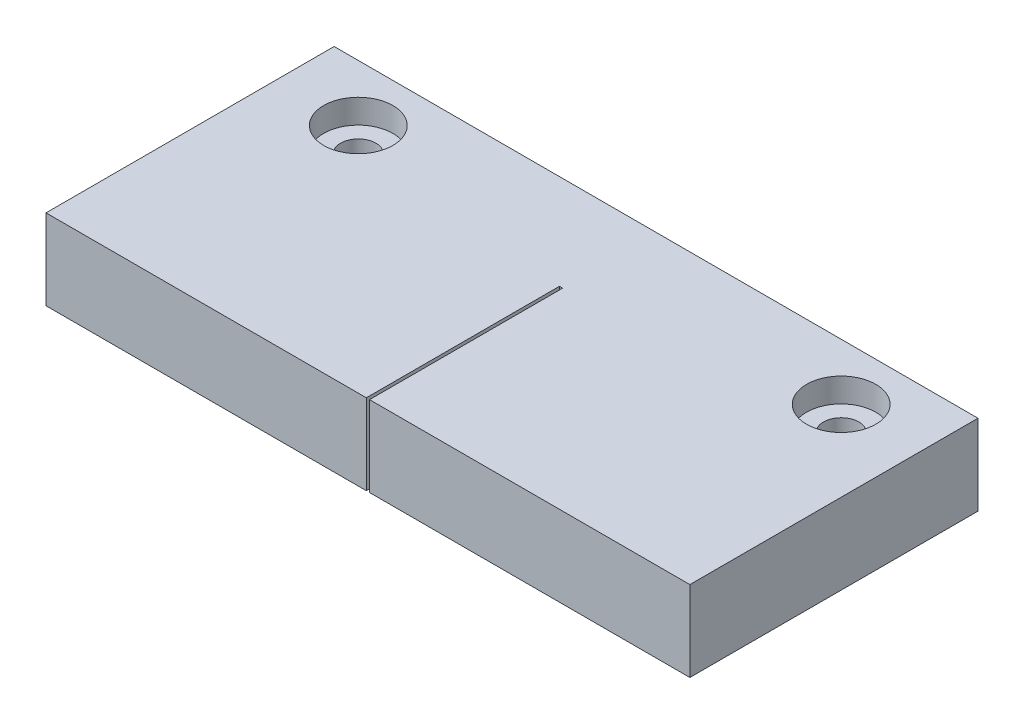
ISO-10303-21;
HEADER;
FILE_DESCRIPTION(('STEP AP214'),'2;1');
FILE_NAME('part.step','',(''),(''),'','','');
FILE_SCHEMA(('AUTOMOTIVE_DESIGN { 1 0 10303 214 1 1 1 1 }'));
ENDSEC;
DATA;
#1=APPLICATION_CONTEXT('core data for automotive mechanical design processes');
#2=APPLICATION_PROTOCOL_DEFINITION('international standard','automotive_design',2000,#1);
#3=PRODUCT_CONTEXT('',#1,'mechanical');
#4=PRODUCT('Part','Part','',(#3));
#5=PRODUCT_RELATED_PRODUCT_CATEGORY('part','',(#4));
#6=PRODUCT_DEFINITION_FORMATION('','',#4);
#7=PRODUCT_DEFINITION_CONTEXT('part definition',#1,'design');
#8=PRODUCT_DEFINITION('design','',#6,#7);
#9=PRODUCT_DEFINITION_SHAPE('','',#8);
#10=(LENGTH_UNIT() NAMED_UNIT(*) SI_UNIT(.MILLI.,.METRE.));
#11=(NAMED_UNIT(*) PLANE_ANGLE_UNIT() SI_UNIT($,.RADIAN.));
#12=(NAMED_UNIT(*) SI_UNIT($,.STERADIAN.) SOLID_ANGLE_UNIT());
#13=UNCERTAINTY_MEASURE_WITH_UNIT(LENGTH_MEASURE(1.E-05),#10,'distance_accuracy_value','');
#14=(GEOMETRIC_REPRESENTATION_CONTEXT(3) GLOBAL_UNCERTAINTY_ASSIGNED_CONTEXT((#13)) GLOBAL_UNIT_ASSIGNED_CONTEXT((#10,
#11,#12)) REPRESENTATION_CONTEXT('',''));
#15=CARTESIAN_POINT('',(0.,0.,0.));
#16=DIRECTION('',(0.,0.,1.));
#17=DIRECTION('',(1.,0.,0.));
#18=AXIS2_PLACEMENT_3D('',#15,#16,#17);
#19=CARTESIAN_POINT('',(-15.,5.,3.5));
#20=DIRECTION('',(0.,1.,0.));
#21=DIRECTION('',(0.,0.,1.));
#22=AXIS2_PLACEMENT_3D('',#19,#20,#21);
#23=CYLINDRICAL_SURFACE('',#22,2.15);
#24=CARTESIAN_POINT('',(-15.,3.5,3.5));
#25=DIRECTION('',(0.,1.,0.));
#26=DIRECTION('',(0.,0.,1.));
#27=AXIS2_PLACEMENT_3D('',#24,#25,#26);
#28=CIRCLE('',#27,2.15);
#29=CARTESIAN_POINT('',(-15.,3.5,5.65));
#30=VERTEX_POINT('',#29);
#31=EDGE_CURVE('E117',#30,#30,#28,.T.);
#32=ORIENTED_EDGE('',*,*,#31,.F.);
#33=EDGE_LOOP('',(#32));
#34=FACE_BOUND('',#33,.T.);
#35=CARTESIAN_POINT('',(-15.,5.,3.5));
#36=DIRECTION('',(0.,1.,0.));
#37=DIRECTION('',(0.,0.,1.));
#38=AXIS2_PLACEMENT_3D('',#35,#36,#37);
#39=CIRCLE('',#38,2.15);
#40=CARTESIAN_POINT('',(-15.,5.,5.65));
#41=VERTEX_POINT('',#40);
#42=EDGE_CURVE('E116',#41,#41,#39,.F.);
#43=ORIENTED_EDGE('',*,*,#42,.F.);
#44=EDGE_LOOP('',(#43));
#45=FACE_BOUND('',#44,.T.);
#46=ADVANCED_FACE('F16',(#34,#45),#23,.F.);
#47=CARTESIAN_POINT('',(15.,5.,3.5));
#48=DIRECTION('',(0.,1.,0.));
#49=DIRECTION('',(0.,0.,1.));
#50=AXIS2_PLACEMENT_3D('',#47,#48,#49);
#51=CYLINDRICAL_SURFACE('',#50,2.15);
#52=CARTESIAN_POINT('',(15.,3.5,3.5));
#53=DIRECTION('',(0.,1.,0.));
#54=DIRECTION('',(0.,0.,1.));
#55=AXIS2_PLACEMENT_3D('',#52,#53,#54);
#56=CIRCLE('',#55,2.15);
#57=CARTESIAN_POINT('',(15.,3.5,5.65));
#58=VERTEX_POINT('',#57);
#59=EDGE_CURVE('E19',#58,#58,#56,.T.);
#60=ORIENTED_EDGE('',*,*,#59,.F.);
#61=EDGE_LOOP('',(#60));
#62=FACE_BOUND('',#61,.T.);
#63=CARTESIAN_POINT('',(15.,5.,3.5));
#64=DIRECTION('',(0.,1.,0.));
#65=DIRECTION('',(0.,0.,1.));
#66=AXIS2_PLACEMENT_3D('',#63,#64,#65);
#67=CIRCLE('',#66,2.15);
#68=CARTESIAN_POINT('',(15.,5.,5.65));
#69=VERTEX_POINT('',#68);
#70=EDGE_CURVE('E102',#69,#69,#67,.F.);
#71=ORIENTED_EDGE('',*,*,#70,.F.);
#72=EDGE_LOOP('',(#71));
#73=FACE_BOUND('',#72,.T.);
#74=ADVANCED_FACE('F142',(#62,#73),#51,.F.);
#75=CARTESIAN_POINT('',(0.,3.5,0.));
#76=DIRECTION('',(0.,1.,0.));
#77=DIRECTION('',(0.,0.,1.));
#78=AXIS2_PLACEMENT_3D('',#75,#76,#77);
#79=PLANE('',#78);
#80=ORIENTED_EDGE('',*,*,#59,.T.);
#81=EDGE_LOOP('',(#80));
#82=FACE_BOUND('',#81,.T.);
#83=CARTESIAN_POINT('',(15.,3.5,3.5));
#84=DIRECTION('',(0.,1.,0.));
#85=DIRECTION('',(0.,0.,1.));
#86=AXIS2_PLACEMENT_3D('',#83,#84,#85);
#87=CIRCLE('',#86,1.1);
#88=CARTESIAN_POINT('',(15.,3.5,4.6));
#89=VERTEX_POINT('',#88);
#90=EDGE_CURVE('E101',#89,#89,#87,.F.);
#91=ORIENTED_EDGE('',*,*,#90,.T.);
#92=EDGE_LOOP('',(#91));
#93=FACE_BOUND('',#92,.T.);
#94=ADVANCED_FACE('F139',(#82,#93),#79,.T.);
#95=CARTESIAN_POINT('',(0.,3.5,0.));
#96=DIRECTION('',(0.,1.,0.));
#97=DIRECTION('',(0.,0.,1.));
#98=AXIS2_PLACEMENT_3D('',#95,#96,#97);
#99=PLANE('',#98);
#100=ORIENTED_EDGE('',*,*,#31,.T.);
#101=EDGE_LOOP('',(#100));
#102=FACE_BOUND('',#101,.T.);
#103=CARTESIAN_POINT('',(-15.,3.5,3.5));
#104=DIRECTION('',(0.,1.,0.));
#105=DIRECTION('',(0.,0.,1.));
#106=AXIS2_PLACEMENT_3D('',#103,#104,#105);
#107=CIRCLE('',#106,1.1);
#108=CARTESIAN_POINT('',(-15.,3.5,4.6));
#109=VERTEX_POINT('',#108);
#110=EDGE_CURVE('E112',#109,#109,#107,.F.);
#111=ORIENTED_EDGE('',*,*,#110,.T.);
#112=EDGE_LOOP('',(#111));
#113=FACE_BOUND('',#112,.T.);
#114=ADVANCED_FACE('F200',(#102,#113),#99,.T.);
#115=CARTESIAN_POINT('',(-0.099999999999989,0.,5.89999999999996));
#116=DIRECTION('',(0.,0.,-1.));
#117=DIRECTION('',(0.,1.,0.));
#118=AXIS2_PLACEMENT_3D('',#115,#116,#117);
#119=PLANE('',#118);
#120=DIRECTION('',(0.,1.,0.));
#121=VECTOR('',#120,1.);
#122=CARTESIAN_POINT('',(-0.099999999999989,0.,5.90000000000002));
#123=LINE('',#122,#121);
#124=CARTESIAN_POINT('',(-0.099999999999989,5.,5.89999999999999));
#125=VERTEX_POINT('',#124);
#126=CARTESIAN_POINT('',(-0.099999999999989,0.,5.89999999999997));
#127=VERTEX_POINT('',#126);
#128=EDGE_CURVE('E84',#125,#127,#123,.F.);
#129=ORIENTED_EDGE('',*,*,#128,.T.);
#130=DIRECTION('',(1.,0.,0.));
#131=VECTOR('',#130,1.);
#132=CARTESIAN_POINT('',(-0.099999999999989,0.,5.89999999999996));
#133=LINE('',#132,#131);
#134=CARTESIAN_POINT('',(0.099999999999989,0.,5.89999999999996));
#135=VERTEX_POINT('',#134);
#136=EDGE_CURVE('E114',#135,#127,#133,.F.);
#137=ORIENTED_EDGE('',*,*,#136,.F.);
#138=DIRECTION('',(0.,1.,0.));
#139=VECTOR('',#138,1.);
#140=CARTESIAN_POINT('',(0.099999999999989,0.,5.89999999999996));
#141=LINE('',#140,#139);
#142=CARTESIAN_POINT('',(0.099999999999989,5.,5.89999999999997));
#143=VERTEX_POINT('',#142);
#144=EDGE_CURVE('E98',#135,#143,#141,.T.);
#145=ORIENTED_EDGE('',*,*,#144,.T.);
#146=DIRECTION('',(1.,0.,0.));
#147=VECTOR('',#146,1.);
#148=CARTESIAN_POINT('',(0.,5.,5.90000000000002));
#149=LINE('',#148,#147);
#150=EDGE_CURVE('E95',#125,#143,#149,.T.);
#151=ORIENTED_EDGE('',*,*,#150,.F.);
#152=EDGE_LOOP('',(#129,#137,#145,#151));
#153=FACE_BOUND('',#152,.T.);
#154=ADVANCED_FACE('F96',(#153),#119,.F.);
#155=CARTESIAN_POINT('',(0.,5.,0.));
#156=DIRECTION('',(0.,1.,0.));
#157=DIRECTION('',(0.,0.,1.));
#158=AXIS2_PLACEMENT_3D('',#155,#156,#157);
#159=PLANE('',#158);
#160=DIRECTION('',(1.,0.,0.));
#161=VECTOR('',#160,1.);
#162=CARTESIAN_POINT('',(20.,5.,0.));
#163=LINE('',#162,#161);
#164=CARTESIAN_POINT('',(-20.,5.,0.));
#165=VERTEX_POINT('',#164);
#166=CARTESIAN_POINT('',(20.,5.,0.));
#167=VERTEX_POINT('',#166);
#168=EDGE_CURVE('E322',#165,#167,#163,.T.);
#169=ORIENTED_EDGE('',*,*,#168,.F.);
#170=DIRECTION('',(0.,0.,1.));
#171=VECTOR('',#170,1.);
#172=CARTESIAN_POINT('',(-20.,5.,0.));
#173=LINE('',#172,#171);
#174=CARTESIAN_POINT('',(-20.,5.,17.9));
#175=VERTEX_POINT('',#174);
#176=EDGE_CURVE('E125',#175,#165,#173,.F.);
#177=ORIENTED_EDGE('',*,*,#176,.F.);
#178=DIRECTION('',(1.,0.,0.));
#179=VECTOR('',#178,1.);
#180=CARTESIAN_POINT('',(-20.,5.,17.9));
#181=LINE('',#180,#179);
#182=CARTESIAN_POINT('',(-0.099999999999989,5.,17.9));
#183=VERTEX_POINT('',#182);
#184=EDGE_CURVE('E78',#183,#175,#181,.F.);
#185=ORIENTED_EDGE('',*,*,#184,.F.);
#186=DIRECTION('',(0.,0.,1.));
#187=VECTOR('',#186,1.);
#188=CARTESIAN_POINT('',(-0.099999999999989,5.,17.9));
#189=LINE('',#188,#187);
#190=EDGE_CURVE('E87',#183,#125,#189,.F.);
#191=ORIENTED_EDGE('',*,*,#190,.T.);
#192=ORIENTED_EDGE('',*,*,#150,.T.);
#193=DIRECTION('',(0.,0.,-1.));
#194=VECTOR('',#193,1.);
#195=CARTESIAN_POINT('',(0.099999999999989,5.,5.89999999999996));
#196=LINE('',#195,#194);
#197=CARTESIAN_POINT('',(0.099999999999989,5.,17.9));
#198=VERTEX_POINT('',#197);
#199=EDGE_CURVE('E107',#143,#198,#196,.F.);
#200=ORIENTED_EDGE('',*,*,#199,.T.);
#201=DIRECTION('',(1.,0.,0.));
#202=VECTOR('',#201,1.);
#203=CARTESIAN_POINT('',(-20.,5.,17.9));
#204=LINE('',#203,#202);
#205=CARTESIAN_POINT('',(20.,5.,17.9));
#206=VERTEX_POINT('',#205);
#207=EDGE_CURVE('E338',#206,#198,#204,.F.);
#208=ORIENTED_EDGE('',*,*,#207,.F.);
#209=DIRECTION('',(0.,0.,-1.));
#210=VECTOR('',#209,1.);
#211=CARTESIAN_POINT('',(20.,5.,17.9));
#212=LINE('',#211,#210);
#213=EDGE_CURVE('E331',#167,#206,#212,.F.);
#214=ORIENTED_EDGE('',*,*,#213,.F.);
#215=EDGE_LOOP('',(#169,#177,#185,#191,#192,#200,#208,#214));
#216=FACE_BOUND('',#215,.T.);
#217=ORIENTED_EDGE('',*,*,#70,.T.);
#218=EDGE_LOOP('',(#217));
#219=FACE_BOUND('',#218,.T.);
#220=ORIENTED_EDGE('',*,*,#42,.T.);
#221=EDGE_LOOP('',(#220));
#222=FACE_BOUND('',#221,.T.);
#223=ADVANCED_FACE('F104',(#216,#219,#222),#159,.T.);
#224=CARTESIAN_POINT('',(15.,0.,3.5));
#225=DIRECTION('',(0.,1.,0.));
#226=DIRECTION('',(0.,0.,1.));
#227=AXIS2_PLACEMENT_3D('',#224,#225,#226);
#228=CYLINDRICAL_SURFACE('',#227,1.1);
#229=ORIENTED_EDGE('',*,*,#90,.F.);
#230=EDGE_LOOP('',(#229));
#231=FACE_BOUND('',#230,.T.);
#232=CARTESIAN_POINT('',(15.,0.,3.5));
#233=DIRECTION('',(0.,1.,0.));
#234=DIRECTION('',(0.,0.,1.));
#235=AXIS2_PLACEMENT_3D('',#232,#233,#234);
#236=CIRCLE('',#235,1.1);
#237=CARTESIAN_POINT('',(15.,0.,4.6));
#238=VERTEX_POINT('',#237);
#239=EDGE_CURVE('E122',#238,#238,#236,.F.);
#240=ORIENTED_EDGE('',*,*,#239,.T.);
#241=EDGE_LOOP('',(#240));
#242=FACE_BOUND('',#241,.T.);
#243=ADVANCED_FACE('F148',(#231,#242),#228,.F.);
#244=CARTESIAN_POINT('',(-15.,0.,3.5));
#245=DIRECTION('',(0.,1.,0.));
#246=DIRECTION('',(0.,0.,1.));
#247=AXIS2_PLACEMENT_3D('',#244,#245,#246);
#248=CYLINDRICAL_SURFACE('',#247,1.1);
#249=ORIENTED_EDGE('',*,*,#110,.F.);
#250=EDGE_LOOP('',(#249));
#251=FACE_BOUND('',#250,.T.);
#252=CARTESIAN_POINT('',(-15.,0.,3.5));
#253=DIRECTION('',(0.,1.,0.));
#254=DIRECTION('',(0.,0.,1.));
#255=AXIS2_PLACEMENT_3D('',#252,#253,#254);
#256=CIRCLE('',#255,1.1);
#257=CARTESIAN_POINT('',(-15.,0.,4.6));
#258=VERTEX_POINT('',#257);
#259=EDGE_CURVE('E118',#258,#258,#256,.F.);
#260=ORIENTED_EDGE('',*,*,#259,.T.);
#261=EDGE_LOOP('',(#260));
#262=FACE_BOUND('',#261,.T.);
#263=ADVANCED_FACE('F190',(#251,#262),#248,.F.);
#264=CARTESIAN_POINT('',(-20.,0.,17.9));
#265=DIRECTION('',(0.,0.,1.));
#266=DIRECTION('',(0.,-1.,0.));
#267=AXIS2_PLACEMENT_3D('',#264,#265,#266);
#268=PLANE('',#267);
#269=ORIENTED_EDGE('',*,*,#184,.T.);
#270=DIRECTION('',(0.,1.,0.));
#271=VECTOR('',#270,1.);
#272=CARTESIAN_POINT('',(-20.,0.,17.9));
#273=LINE('',#272,#271);
#274=CARTESIAN_POINT('',(-20.,0.,17.9));
#275=VERTEX_POINT('',#274);
#276=EDGE_CURVE('E319',#275,#175,#273,.T.);
#277=ORIENTED_EDGE('',*,*,#276,.F.);
#278=DIRECTION('',(1.,0.,0.));
#279=VECTOR('',#278,1.);
#280=CARTESIAN_POINT('',(0.,0.,17.9));
#281=LINE('',#280,#279);
#282=CARTESIAN_POINT('',(-0.099999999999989,0.,17.9));
#283=VERTEX_POINT('',#282);
#284=EDGE_CURVE('E121',#275,#283,#281,.T.);
#285=ORIENTED_EDGE('',*,*,#284,.T.);
#286=DIRECTION('',(0.,1.,0.));
#287=VECTOR('',#286,1.);
#288=CARTESIAN_POINT('',(-0.099999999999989,0.,17.9));
#289=LINE('',#288,#287);
#290=EDGE_CURVE('E92',#283,#183,#289,.T.);
#291=ORIENTED_EDGE('',*,*,#290,.T.);
#292=EDGE_LOOP('',(#269,#277,#285,#291));
#293=FACE_BOUND('',#292,.T.);
#294=ADVANCED_FACE('F187',(#293),#268,.T.);
#295=CARTESIAN_POINT('',(-0.099999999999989,0.,17.9));
#296=DIRECTION('',(-1.,0.,0.));
#297=DIRECTION('',(0.,0.,1.));
#298=AXIS2_PLACEMENT_3D('',#295,#296,#297);
#299=PLANE('',#298);
#300=ORIENTED_EDGE('',*,*,#290,.F.);
#301=DIRECTION('',(0.,0.,1.));
#302=VECTOR('',#301,1.);
#303=CARTESIAN_POINT('',(-0.099999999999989,0.,0.));
#304=LINE('',#303,#302);
#305=EDGE_CURVE('E90',#283,#127,#304,.F.);
#306=ORIENTED_EDGE('',*,*,#305,.T.);
#307=ORIENTED_EDGE('',*,*,#128,.F.);
#308=ORIENTED_EDGE('',*,*,#190,.F.);
#309=EDGE_LOOP('',(#300,#306,#307,#308));
#310=FACE_BOUND('',#309,.T.);
#311=ADVANCED_FACE('F86',(#310),#299,.F.);
#312=CARTESIAN_POINT('',(0.099999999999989,0.,5.89999999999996));
#313=DIRECTION('',(1.,0.,0.));
#314=DIRECTION('',(0.,0.,-1.));
#315=AXIS2_PLACEMENT_3D('',#312,#313,#314);
#316=PLANE('',#315);
#317=ORIENTED_EDGE('',*,*,#144,.F.);
#318=DIRECTION('',(0.,0.,1.));
#319=VECTOR('',#318,1.);
#320=CARTESIAN_POINT('',(0.099999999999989,0.,0.));
#321=LINE('',#320,#319);
#322=CARTESIAN_POINT('',(0.099999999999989,0.,17.9));
#323=VERTEX_POINT('',#322);
#324=EDGE_CURVE('E342',#135,#323,#321,.T.);
#325=ORIENTED_EDGE('',*,*,#324,.T.);
#326=DIRECTION('',(0.,-1.,0.));
#327=VECTOR('',#326,1.);
#328=CARTESIAN_POINT('',(0.099999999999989,0.,17.9));
#329=LINE('',#328,#327);
#330=EDGE_CURVE('E336',#198,#323,#329,.T.);
#331=ORIENTED_EDGE('',*,*,#330,.F.);
#332=ORIENTED_EDGE('',*,*,#199,.F.);
#333=EDGE_LOOP('',(#317,#325,#331,#332));
#334=FACE_BOUND('',#333,.T.);
#335=ADVANCED_FACE('F180',(#334),#316,.F.);
#336=CARTESIAN_POINT('',(-20.,0.,17.9));
#337=DIRECTION('',(0.,0.,1.));
#338=DIRECTION('',(0.,-1.,0.));
#339=AXIS2_PLACEMENT_3D('',#336,#337,#338);
#340=PLANE('',#339);
#341=DIRECTION('',(1.,0.,0.));
#342=VECTOR('',#341,1.);
#343=CARTESIAN_POINT('',(0.,0.,17.9));
#344=LINE('',#343,#342);
#345=CARTESIAN_POINT('',(20.,0.,17.9));
#346=VERTEX_POINT('',#345);
#347=EDGE_CURVE('E346',#323,#346,#344,.T.);
#348=ORIENTED_EDGE('',*,*,#347,.T.);
#349=DIRECTION('',(0.,1.,0.));
#350=VECTOR('',#349,1.);
#351=CARTESIAN_POINT('',(20.,0.,17.9));
#352=LINE('',#351,#350);
#353=EDGE_CURVE('E334',#206,#346,#352,.F.);
#354=ORIENTED_EDGE('',*,*,#353,.F.);
#355=ORIENTED_EDGE('',*,*,#207,.T.);
#356=ORIENTED_EDGE('',*,*,#330,.T.);
#357=EDGE_LOOP('',(#348,#354,#355,#356));
#358=FACE_BOUND('',#357,.T.);
#359=ADVANCED_FACE('F176',(#358),#340,.T.);
#360=CARTESIAN_POINT('',(20.,0.,17.9));
#361=DIRECTION('',(1.,0.,0.));
#362=DIRECTION('',(0.,0.,-1.));
#363=AXIS2_PLACEMENT_3D('',#360,#361,#362);
#364=PLANE('',#363);
#365=DIRECTION('',(0.,1.,0.));
#366=VECTOR('',#365,1.);
#367=CARTESIAN_POINT('',(20.,0.,0.));
#368=LINE('',#367,#366);
#369=CARTESIAN_POINT('',(20.,0.,0.));
#370=VERTEX_POINT('',#369);
#371=EDGE_CURVE('E329',#167,#370,#368,.F.);
#372=ORIENTED_EDGE('',*,*,#371,.F.);
#373=ORIENTED_EDGE('',*,*,#213,.T.);
#374=ORIENTED_EDGE('',*,*,#353,.T.);
#375=DIRECTION('',(0.,0.,1.));
#376=VECTOR('',#375,1.);
#377=CARTESIAN_POINT('',(20.,0.,0.));
#378=LINE('',#377,#376);
#379=EDGE_CURVE('E349',#346,#370,#378,.F.);
#380=ORIENTED_EDGE('',*,*,#379,.T.);
#381=EDGE_LOOP('',(#372,#373,#374,#380));
#382=FACE_BOUND('',#381,.T.);
#383=ADVANCED_FACE('F172',(#382),#364,.T.);
#384=CARTESIAN_POINT('',(20.,0.,0.));
#385=DIRECTION('',(0.,0.,-1.));
#386=DIRECTION('',(0.,1.,0.));
#387=AXIS2_PLACEMENT_3D('',#384,#385,#386);
#388=PLANE('',#387);
#389=DIRECTION('',(0.,1.,0.));
#390=VECTOR('',#389,1.);
#391=CARTESIAN_POINT('',(-20.,0.,0.));
#392=LINE('',#391,#390);
#393=CARTESIAN_POINT('',(-20.,0.,0.));
#394=VERTEX_POINT('',#393);
#395=EDGE_CURVE('E33',#165,#394,#392,.F.);
#396=ORIENTED_EDGE('',*,*,#395,.F.);
#397=ORIENTED_EDGE('',*,*,#168,.T.);
#398=ORIENTED_EDGE('',*,*,#371,.T.);
#399=DIRECTION('',(1.,0.,0.));
#400=VECTOR('',#399,1.);
#401=CARTESIAN_POINT('',(0.,0.,0.));
#402=LINE('',#401,#400);
#403=EDGE_CURVE('E25',#370,#394,#402,.F.);
#404=ORIENTED_EDGE('',*,*,#403,.T.);
#405=EDGE_LOOP('',(#396,#397,#398,#404));
#406=FACE_BOUND('',#405,.T.);
#407=ADVANCED_FACE('F165',(#406),#388,.T.);
#408=CARTESIAN_POINT('',(-20.,0.,0.));
#409=DIRECTION('',(-1.,0.,0.));
#410=DIRECTION('',(0.,0.,1.));
#411=AXIS2_PLACEMENT_3D('',#408,#409,#410);
#412=PLANE('',#411);
#413=ORIENTED_EDGE('',*,*,#276,.T.);
#414=ORIENTED_EDGE('',*,*,#176,.T.);
#415=ORIENTED_EDGE('',*,*,#395,.T.);
#416=DIRECTION('',(0.,0.,1.));
#417=VECTOR('',#416,1.);
#418=CARTESIAN_POINT('',(-20.,0.,0.));
#419=LINE('',#418,#417);
#420=EDGE_CURVE('E11',#394,#275,#419,.T.);
#421=ORIENTED_EDGE('',*,*,#420,.T.);
#422=EDGE_LOOP('',(#413,#414,#415,#421));
#423=FACE_BOUND('',#422,.T.);
#424=ADVANCED_FACE('F159',(#423),#412,.T.);
#425=CARTESIAN_POINT('',(0.,0.,0.));
#426=DIRECTION('',(0.,1.,0.));
#427=DIRECTION('',(0.,0.,1.));
#428=AXIS2_PLACEMENT_3D('',#425,#426,#427);
#429=PLANE('',#428);
#430=ORIENTED_EDGE('',*,*,#403,.F.);
#431=ORIENTED_EDGE('',*,*,#379,.F.);
#432=ORIENTED_EDGE('',*,*,#347,.F.);
#433=ORIENTED_EDGE('',*,*,#324,.F.);
#434=ORIENTED_EDGE('',*,*,#136,.T.);
#435=ORIENTED_EDGE('',*,*,#305,.F.);
#436=ORIENTED_EDGE('',*,*,#284,.F.);
#437=ORIENTED_EDGE('',*,*,#420,.F.);
#438=EDGE_LOOP('',(#430,#431,#432,#433,#434,#435,#436,#437));
#439=FACE_BOUND('',#438,.T.);
#440=ORIENTED_EDGE('',*,*,#259,.F.);
#441=EDGE_LOOP('',(#440));
#442=FACE_BOUND('',#441,.T.);
#443=ORIENTED_EDGE('',*,*,#239,.F.);
#444=EDGE_LOOP('',(#443));
#445=FACE_BOUND('',#444,.T.);
#446=ADVANCED_FACE('F157',(#439,#442,#445),#429,.F.);
#447=CLOSED_SHELL('',(#46,#74,#94,#114,#154,#223,#243,#263,#294,#311,#335,#359,#383,#407,#424,#446));
#448=MANIFOLD_SOLID_BREP('B1',#447);
#449=ADVANCED_BREP_SHAPE_REPRESENTATION('',(#18,#448),#14);
#450=SHAPE_DEFINITION_REPRESENTATION(#9,#449);
ENDSEC;
END-ISO-10303-21;
